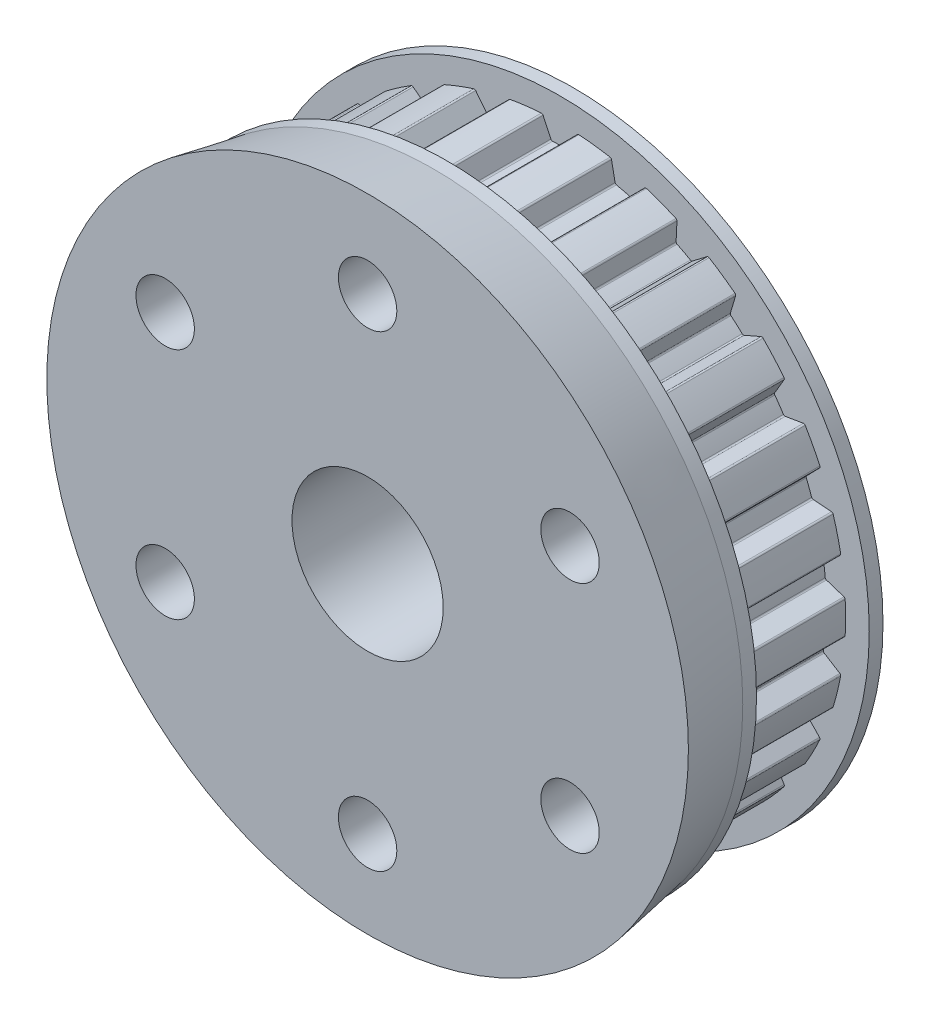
from build123d import *

# Parameters (mm, degrees)
SKETCH1_R                  = 20.765
BOSS_EXTRUDE1_DEPTH        = 8.2
CUT_EXTRUDE1_REACH         = 32.49
FILLET1_R                  = 0.13
CIRPATTERN1_COUNT          = 26
FILLET1_OF_CIRPATTERN1_R   = 0.13
CROQUIS1_R                 = 22.485
SALIENTE_EXTRUIR1_DEPTH    = 1
CROQUIS4_R                 = 22.485
SALIENTE_EXTRUIR2_DEPTH    = 4.8
SALIENTE_EXTRUIR2_DRAFT    = -10
CORTAR_EXTRUIR1_DEPTH      = 36.842790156
CORTAR_EXTRUIR1_DEPTH_BACK = 36.842790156
CROQUIS2_R                 = 5.5
CORTAR_EXTRUIR2_DEPTH      = 36.842790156
CORTAR_EXTRUIR2_DEPTH_BACK = 36.842790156
CROQUIS3_R                 = 2.125


with BuildPart() as part:
    # Sketch1 → Boss-Extrude1 (new body)
    with BuildSketch(Plane.XY):
        Circle(SKETCH1_R)
    extrude(amount=BOSS_EXTRUDE1_DEPTH)

    # Sketch2 → Cut-Extrude1 (cut, up to next)
    with BuildSketch(Plane.XY.offset(8.2), mode=Mode.PRIVATE) as cut_extrude1_sk1:
        with BuildLine():
            Line((-1.274433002, 20.725854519), (-0.671193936, 19.432204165))
            ThreePointArc((-0.671193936, 19.432204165), (-0.621659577, 19.376523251), (-0.549683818, 19.357196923))
            ThreePointArc((-0.549683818, 19.357196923), (0, 19.365), (0.549683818, 19.357196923))
            ThreePointArc((0.549683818, 19.357196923), (0.621659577, 19.376523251), (0.671193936, 19.432204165))
            Line((0.671193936, 19.432204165), (1.274433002, 20.725854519))
            ThreePointArc((1.274433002, 20.725854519), (0, 20.765), (-1.274433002, 20.725854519))
        make_face()
    cut_extrude1_tool1 = extrude(cut_extrude1_sk1.sketch, amount=-CUT_EXTRUDE1_REACH, mode=Mode.PRIVATE) & part.part
    cut_extrude1 = cut_extrude1_tool1.solids().sort_by_distance((0, 20.13552, 8.2))[0]
    add(cut_extrude1, mode=Mode.SUBTRACT)

    # Fillet1
    fillet1_edges = [part.edges().sort_by_distance(p)[0] for p in [
        (-1.274433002, 20.725854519, 4.1),
        (1.274433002, 20.725854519, 4.1),
    ]]
    fillet(fillet1_edges, radius=FILLET1_R)

    # CirPattern1: Cut-Extrude1 ×26 about axis
    cirpattern1_axis = Axis((0, 0, 0), (0, 0, 1))
    for i in range(1, CIRPATTERN1_COUNT):
        add(cut_extrude1.rotate(cirpattern1_axis, i * 360 / CIRPATTERN1_COUNT), mode=Mode.SUBTRACT)

    # Fillet1 of CirPattern1
    fillet1_of_cirpattern1_edges = [part.edges().sort_by_distance(p)[0] for p in [
        (-6.197421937, 19.818607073, 4.1),
        (-3.722621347, 20.428590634, 4.1),
        (-10.760239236, 17.759574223, 4.1),
        (-8.503330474, 18.944091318, 4.1),
        (-14.697710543, 14.668419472, 4.1),
        (-12.789856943, 16.358630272, 4.1),
        (-17.781004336, 10.724789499, 4.1),
        (-16.333083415, 12.822465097, 4.1),
        (-19.830930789, 6.157873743, 4.1),
        (-18.927090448, 8.541104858, 4.1),
        (-20.728355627, 1.233084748, 4.1),
        (-20.42112378, 3.76336665, 4.1),
        (-20.42112378, -3.76336665, 4.1),
        (-20.728355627, -1.233084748, 4.1),
        (-18.927090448, -8.541104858, 4.1),
        (-19.830930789, -6.157873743, 4.1),
        (-16.333083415, -12.822465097, 4.1),
        (-17.781004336, -10.724789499, 4.1),
        (-12.789856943, -16.358630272, 4.1),
        (-14.697710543, -14.668419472, 4.1),
        (-8.503330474, -18.944091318, 4.1),
        (-10.760239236, -17.759574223, 4.1),
        (-3.722621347, -20.428590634, 4.1),
        (-6.197421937, -19.818607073, 4.1),
        (1.274433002, -20.725854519, 4.1),
        (-1.274433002, -20.725854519, 4.1),
        (6.197421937, -19.818607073, 4.1),
        (3.722621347, -20.428590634, 4.1),
        (10.760239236, -17.759574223, 4.1),
        (8.503330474, -18.944091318, 4.1),
        (14.697710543, -14.668419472, 4.1),
        (12.789856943, -16.358630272, 4.1),
        (17.781004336, -10.724789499, 4.1),
        (16.333083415, -12.822465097, 4.1),
        (19.830930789, -6.157873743, 4.1),
        (18.927090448, -8.541104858, 4.1),
        (20.728355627, -1.233084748, 4.1),
        (20.42112378, -3.76336665, 4.1),
        (20.42112378, 3.76336665, 4.1),
        (20.728355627, 1.233084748, 4.1),
        (18.927090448, 8.541104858, 4.1),
        (19.830930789, 6.157873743, 4.1),
        (16.333083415, 12.822465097, 4.1),
        (17.781004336, 10.724789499, 4.1),
        (12.789856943, 16.358630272, 4.1),
        (14.697710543, 14.668419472, 4.1),
        (8.503330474, 18.944091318, 4.1),
        (10.760239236, 17.759574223, 4.1),
        (3.722621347, 20.428590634, 4.1),
        (6.197421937, 19.818607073, 4.1),
    ]]
    fillet(fillet1_of_cirpattern1_edges, radius=FILLET1_OF_CIRPATTERN1_R)

    # Croquis1 → Saliente-Extruir1 (add)
    with BuildSketch(Plane.XY.offset(8.2)):
        Circle(CROQUIS1_R)
    saliente_extruir1 = extrude(amount=SALIENTE_EXTRUIR1_DEPTH)

    # Simetr_a1: Saliente-Extruir1 across plane
    add(saliente_extruir1.mirror(Plane.XY.offset(4.1)))


with BuildPart() as saliente_extruir2_tool:
    # Croquis4 → Saliente-Extruir2 (with draft: the straight prism first)
    with BuildSketch(Plane.XY.offset(9.2)):
        Circle(CROQUIS4_R)
    extrude(amount=SALIENTE_EXTRUIR2_DEPTH)
    # Saliente-Extruir2: the draft: its side faces are tilted about the plane it starts from
    saliente_extruir2_sides = [saliente_extruir2_tool.faces().sort_by_distance(p)[0] for p in [
        (-22.485, 0, 11.6),
    ]]
    draft(saliente_extruir2_sides, Plane.XY.offset(9.2), SALIENTE_EXTRUIR2_DRAFT)


with BuildPart() as part_1:
    add(part.part)

    # Saliente-Extruir2: add saliente_extruir2_tool
    add(saliente_extruir2_tool.part)

    # Croquis2 → Cortar-Extruir1 (cut, two sides: drawn at the far end of the back side and taken through both)
    with BuildSketch(Plane.XY.offset(-CORTAR_EXTRUIR1_DEPTH_BACK)):
        Circle(CROQUIS2_R)
    extrude(amount=CORTAR_EXTRUIR1_DEPTH + CORTAR_EXTRUIR1_DEPTH_BACK, mode=Mode.SUBTRACT)

    # Croquis3 → Cortar-Extruir2 (cut, two sides: drawn at the far end of the back side and taken through both)
    with BuildSketch(Plane.XY.offset(-CORTAR_EXTRUIR2_DEPTH_BACK)):
        with Locations((0, 17)):
            Circle(CROQUIS3_R)
        with Locations((14.722431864, 8.5)):
            Circle(CROQUIS3_R)
        with Locations((14.722431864, -8.5)):
            Circle(CROQUIS3_R)
        with Locations((0, -17)):
            Circle(CROQUIS3_R)
        with Locations((-14.722431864, -8.5)):
            Circle(CROQUIS3_R)
        with Locations((-14.722431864, 8.5)):
            Circle(CROQUIS3_R)
    extrude(amount=CORTAR_EXTRUIR2_DEPTH + CORTAR_EXTRUIR2_DEPTH_BACK, mode=Mode.SUBTRACT)


solid = part_1.part
